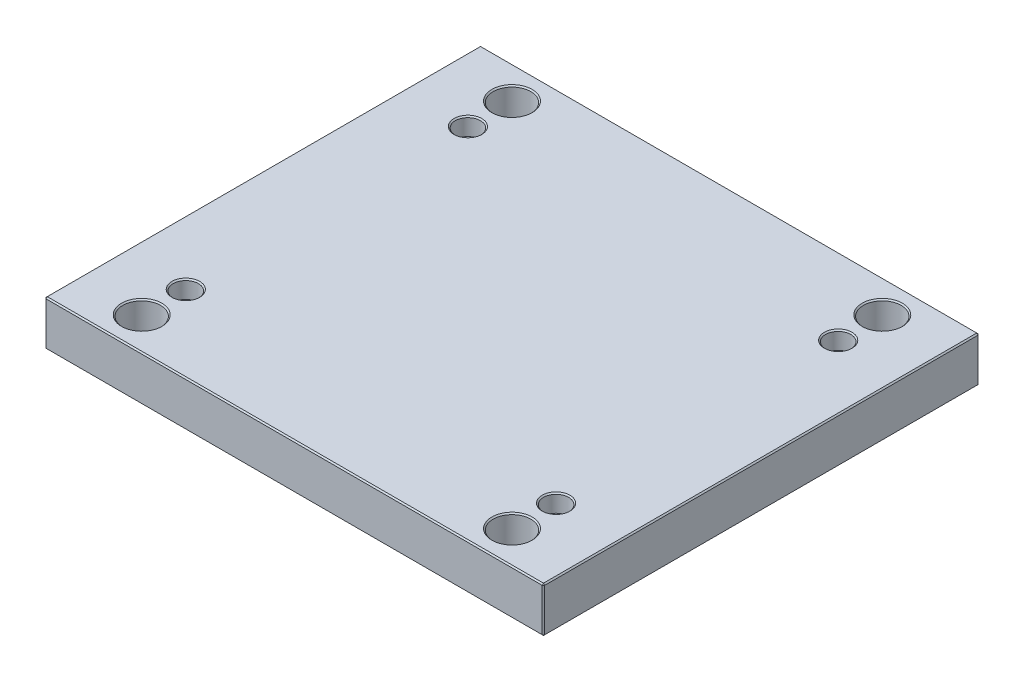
ISO-10303-21;
HEADER;
FILE_DESCRIPTION(('STEP AP214'),'2;1');
FILE_NAME('part.step','',(''),(''),'','','');
FILE_SCHEMA(('AUTOMOTIVE_DESIGN { 1 0 10303 214 1 1 1 1 }'));
ENDSEC;
DATA;
#1=APPLICATION_CONTEXT('core data for automotive mechanical design processes');
#2=APPLICATION_PROTOCOL_DEFINITION('international standard','automotive_design',2000,#1);
#3=PRODUCT_CONTEXT('',#1,'mechanical');
#4=PRODUCT('Part','Part','',(#3));
#5=PRODUCT_RELATED_PRODUCT_CATEGORY('part','',(#4));
#6=PRODUCT_DEFINITION_FORMATION('','',#4);
#7=PRODUCT_DEFINITION_CONTEXT('part definition',#1,'design');
#8=PRODUCT_DEFINITION('design','',#6,#7);
#9=PRODUCT_DEFINITION_SHAPE('','',#8);
#10=(LENGTH_UNIT() NAMED_UNIT(*) SI_UNIT(.MILLI.,.METRE.));
#11=(NAMED_UNIT(*) PLANE_ANGLE_UNIT() SI_UNIT($,.RADIAN.));
#12=(NAMED_UNIT(*) SI_UNIT($,.STERADIAN.) SOLID_ANGLE_UNIT());
#13=UNCERTAINTY_MEASURE_WITH_UNIT(LENGTH_MEASURE(1.E-05),#10,'distance_accuracy_value','');
#14=(GEOMETRIC_REPRESENTATION_CONTEXT(3) GLOBAL_UNCERTAINTY_ASSIGNED_CONTEXT((#13)) GLOBAL_UNIT_ASSIGNED_CONTEXT((#10,
#11,#12)) REPRESENTATION_CONTEXT('',''));
#15=CARTESIAN_POINT('',(0.,0.,0.));
#16=DIRECTION('',(0.,0.,1.));
#17=DIRECTION('',(1.,0.,0.));
#18=AXIS2_PLACEMENT_3D('',#15,#16,#17);
#19=CARTESIAN_POINT('',(-198.,36.,173.));
#20=DIRECTION('',(1.,0.,0.));
#21=DIRECTION('',(0.,0.,-1.));
#22=AXIS2_PLACEMENT_3D('',#19,#20,#21);
#23=PLANE('',#22);
#24=DIRECTION('',(0.,-1.,0.));
#25=VECTOR('',#24,1.);
#26=CARTESIAN_POINT('',(-198.,36.,-172.));
#27=LINE('',#26,#25);
#28=CARTESIAN_POINT('',(-198.,35.,-172.));
#29=VERTEX_POINT('',#28);
#30=CARTESIAN_POINT('',(-198.,1.,-172.));
#31=VERTEX_POINT('',#30);
#32=EDGE_CURVE('E115',#29,#31,#27,.T.);
#33=ORIENTED_EDGE('',*,*,#32,.T.);
#34=DIRECTION('',(0.,0.,1.));
#35=VECTOR('',#34,1.);
#36=CARTESIAN_POINT('',(-198.,1.,173.));
#37=LINE('',#36,#35);
#38=CARTESIAN_POINT('',(-198.,1.,172.));
#39=VERTEX_POINT('',#38);
#40=EDGE_CURVE('E111',#31,#39,#37,.T.);
#41=ORIENTED_EDGE('',*,*,#40,.T.);
#42=DIRECTION('',(0.,1.,0.));
#43=VECTOR('',#42,1.);
#44=CARTESIAN_POINT('',(-198.,36.,172.));
#45=LINE('',#44,#43);
#46=CARTESIAN_POINT('',(-198.,35.,172.));
#47=VERTEX_POINT('',#46);
#48=EDGE_CURVE('E104',#39,#47,#45,.T.);
#49=ORIENTED_EDGE('',*,*,#48,.T.);
#50=DIRECTION('',(0.,0.,-1.));
#51=VECTOR('',#50,1.);
#52=CARTESIAN_POINT('',(-198.,35.,-173.));
#53=LINE('',#52,#51);
#54=EDGE_CURVE('E108',#47,#29,#53,.T.);
#55=ORIENTED_EDGE('',*,*,#54,.T.);
#56=EDGE_LOOP('',(#33,#41,#49,#55));
#57=FACE_BOUND('',#56,.T.);
#58=ADVANCED_FACE('F16',(#57),#23,.F.);
#59=CARTESIAN_POINT('',(198.,36.,173.));
#60=DIRECTION('',(0.,0.,-1.));
#61=DIRECTION('',(-1.,0.,0.));
#62=AXIS2_PLACEMENT_3D('',#59,#60,#61);
#63=PLANE('',#62);
#64=DIRECTION('',(-1.,0.,0.));
#65=VECTOR('',#64,1.);
#66=CARTESIAN_POINT('',(-198.,35.,173.));
#67=LINE('',#66,#65);
#68=CARTESIAN_POINT('',(197.,35.,173.));
#69=VERTEX_POINT('',#68);
#70=CARTESIAN_POINT('',(-197.,35.,173.));
#71=VERTEX_POINT('',#70);
#72=EDGE_CURVE('E170',#69,#71,#67,.T.);
#73=ORIENTED_EDGE('',*,*,#72,.T.);
#74=DIRECTION('',(0.,-1.,0.));
#75=VECTOR('',#74,1.);
#76=CARTESIAN_POINT('',(-197.,36.,173.));
#77=LINE('',#76,#75);
#78=CARTESIAN_POINT('',(-197.,1.00000000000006,173.));
#79=VERTEX_POINT('',#78);
#80=EDGE_CURVE('E123',#71,#79,#77,.T.);
#81=ORIENTED_EDGE('',*,*,#80,.T.);
#82=DIRECTION('',(1.,0.,0.));
#83=VECTOR('',#82,1.);
#84=CARTESIAN_POINT('',(198.,1.00000000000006,173.));
#85=LINE('',#84,#83);
#86=CARTESIAN_POINT('',(197.,1.00000000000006,173.));
#87=VERTEX_POINT('',#86);
#88=EDGE_CURVE('E174',#79,#87,#85,.T.);
#89=ORIENTED_EDGE('',*,*,#88,.T.);
#90=DIRECTION('',(0.,1.,0.));
#91=VECTOR('',#90,1.);
#92=CARTESIAN_POINT('',(197.,36.,173.));
#93=LINE('',#92,#91);
#94=EDGE_CURVE('E172',#87,#69,#93,.T.);
#95=ORIENTED_EDGE('',*,*,#94,.T.);
#96=EDGE_LOOP('',(#73,#81,#89,#95));
#97=FACE_BOUND('',#96,.T.);
#98=ADVANCED_FACE('F413',(#97),#63,.F.);
#99=CARTESIAN_POINT('',(198.,36.,173.));
#100=DIRECTION('',(-1.,0.,0.));
#101=DIRECTION('',(0.,0.,1.));
#102=AXIS2_PLACEMENT_3D('',#99,#100,#101);
#103=PLANE('',#102);
#104=DIRECTION('',(0.,0.,-1.));
#105=VECTOR('',#104,1.);
#106=CARTESIAN_POINT('',(198.,1.00000000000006,173.));
#107=LINE('',#106,#105);
#108=CARTESIAN_POINT('',(198.,1.00000000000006,172.));
#109=VERTEX_POINT('',#108);
#110=CARTESIAN_POINT('',(198.,1.00000000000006,-172.));
#111=VERTEX_POINT('',#110);
#112=EDGE_CURVE('E165',#109,#111,#107,.T.);
#113=ORIENTED_EDGE('',*,*,#112,.T.);
#114=DIRECTION('',(0.,1.,0.));
#115=VECTOR('',#114,1.);
#116=CARTESIAN_POINT('',(198.,36.,-172.));
#117=LINE('',#116,#115);
#118=CARTESIAN_POINT('',(198.,35.,-172.));
#119=VERTEX_POINT('',#118);
#120=EDGE_CURVE('E167',#111,#119,#117,.T.);
#121=ORIENTED_EDGE('',*,*,#120,.T.);
#122=DIRECTION('',(0.,0.,1.));
#123=VECTOR('',#122,1.);
#124=CARTESIAN_POINT('',(198.,35.,173.));
#125=LINE('',#124,#123);
#126=CARTESIAN_POINT('',(198.,35.,172.));
#127=VERTEX_POINT('',#126);
#128=EDGE_CURVE('E161',#119,#127,#125,.T.);
#129=ORIENTED_EDGE('',*,*,#128,.T.);
#130=DIRECTION('',(0.,-1.,0.));
#131=VECTOR('',#130,1.);
#132=CARTESIAN_POINT('',(198.,36.,172.));
#133=LINE('',#132,#131);
#134=EDGE_CURVE('E163',#127,#109,#133,.T.);
#135=ORIENTED_EDGE('',*,*,#134,.T.);
#136=EDGE_LOOP('',(#113,#121,#129,#135));
#137=FACE_BOUND('',#136,.T.);
#138=ADVANCED_FACE('F406',(#137),#103,.F.);
#139=CARTESIAN_POINT('',(198.,36.,-173.));
#140=DIRECTION('',(0.,0.,1.));
#141=DIRECTION('',(1.,0.,0.));
#142=AXIS2_PLACEMENT_3D('',#139,#140,#141);
#143=PLANE('',#142);
#144=DIRECTION('',(0.,-1.,0.));
#145=VECTOR('',#144,1.);
#146=CARTESIAN_POINT('',(197.,36.,-173.));
#147=LINE('',#146,#145);
#148=CARTESIAN_POINT('',(197.,35.,-173.));
#149=VERTEX_POINT('',#148);
#150=CARTESIAN_POINT('',(197.,1.00000000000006,-173.));
#151=VERTEX_POINT('',#150);
#152=EDGE_CURVE('E154',#149,#151,#147,.T.);
#153=ORIENTED_EDGE('',*,*,#152,.T.);
#154=DIRECTION('',(-1.,0.,0.));
#155=VECTOR('',#154,1.);
#156=CARTESIAN_POINT('',(198.,1.00000000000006,-173.));
#157=LINE('',#156,#155);
#158=CARTESIAN_POINT('',(-197.,1.00000000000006,-173.));
#159=VERTEX_POINT('',#158);
#160=EDGE_CURVE('E159',#151,#159,#157,.T.);
#161=ORIENTED_EDGE('',*,*,#160,.T.);
#162=DIRECTION('',(0.,1.,0.));
#163=VECTOR('',#162,1.);
#164=CARTESIAN_POINT('',(-197.,36.,-173.));
#165=LINE('',#164,#163);
#166=CARTESIAN_POINT('',(-197.,35.,-173.));
#167=VERTEX_POINT('',#166);
#168=EDGE_CURVE('E156',#159,#167,#165,.T.);
#169=ORIENTED_EDGE('',*,*,#168,.T.);
#170=DIRECTION('',(1.,0.,0.));
#171=VECTOR('',#170,1.);
#172=CARTESIAN_POINT('',(198.,35.,-173.));
#173=LINE('',#172,#171);
#174=EDGE_CURVE('E152',#167,#149,#173,.T.);
#175=ORIENTED_EDGE('',*,*,#174,.T.);
#176=EDGE_LOOP('',(#153,#161,#169,#175));
#177=FACE_BOUND('',#176,.T.);
#178=ADVANCED_FACE('F431',(#177),#143,.F.);
#179=CARTESIAN_POINT('',(0.,36.,0.));
#180=DIRECTION('',(0.,1.,0.));
#181=DIRECTION('',(0.,0.,1.));
#182=AXIS2_PLACEMENT_3D('',#179,#180,#181);
#183=PLANE('',#182);
#184=CARTESIAN_POINT('',(-147.,36.,147.));
#185=DIRECTION('',(0.,1.,0.));
#186=DIRECTION('',(0.,0.,1.));
#187=AXIS2_PLACEMENT_3D('',#184,#185,#186);
#188=CIRCLE('',#187,16.);
#189=CARTESIAN_POINT('',(-147.,36.,163.));
#190=VERTEX_POINT('',#189);
#191=EDGE_CURVE('E317',#190,#190,#188,.F.);
#192=ORIENTED_EDGE('',*,*,#191,.T.);
#193=EDGE_LOOP('',(#192));
#194=FACE_BOUND('',#193,.T.);
#195=CARTESIAN_POINT('',(147.,36.,147.));
#196=DIRECTION('',(0.,1.,0.));
#197=DIRECTION('',(0.,0.,1.));
#198=AXIS2_PLACEMENT_3D('',#195,#196,#197);
#199=CIRCLE('',#198,16.);
#200=CARTESIAN_POINT('',(147.,36.,163.));
#201=VERTEX_POINT('',#200);
#202=EDGE_CURVE('E314',#201,#201,#199,.F.);
#203=ORIENTED_EDGE('',*,*,#202,.T.);
#204=EDGE_LOOP('',(#203));
#205=FACE_BOUND('',#204,.T.);
#206=CARTESIAN_POINT('',(147.,36.,-147.));
#207=DIRECTION('',(0.,1.,0.));
#208=DIRECTION('',(0.,0.,1.));
#209=AXIS2_PLACEMENT_3D('',#206,#207,#208);
#210=CIRCLE('',#209,16.);
#211=CARTESIAN_POINT('',(147.,36.,-131.));
#212=VERTEX_POINT('',#211);
#213=EDGE_CURVE('E311',#212,#212,#210,.F.);
#214=ORIENTED_EDGE('',*,*,#213,.T.);
#215=EDGE_LOOP('',(#214));
#216=FACE_BOUND('',#215,.T.);
#217=CARTESIAN_POINT('',(-147.,36.,-147.));
#218=DIRECTION('',(0.,1.,0.));
#219=DIRECTION('',(0.,0.,1.));
#220=AXIS2_PLACEMENT_3D('',#217,#218,#219);
#221=CIRCLE('',#220,16.);
#222=CARTESIAN_POINT('',(-147.,36.,-131.));
#223=VERTEX_POINT('',#222);
#224=EDGE_CURVE('E308',#223,#223,#221,.F.);
#225=ORIENTED_EDGE('',*,*,#224,.T.);
#226=EDGE_LOOP('',(#225));
#227=FACE_BOUND('',#226,.T.);
#228=CARTESIAN_POINT('',(-147.,36.,112.));
#229=DIRECTION('',(0.,1.,0.));
#230=DIRECTION('',(0.,0.,1.));
#231=AXIS2_PLACEMENT_3D('',#228,#229,#230);
#232=CIRCLE('',#231,11.);
#233=CARTESIAN_POINT('',(-147.,36.,123.));
#234=VERTEX_POINT('',#233);
#235=EDGE_CURVE('E290',#234,#234,#232,.F.);
#236=ORIENTED_EDGE('',*,*,#235,.T.);
#237=EDGE_LOOP('',(#236));
#238=FACE_BOUND('',#237,.T.);
#239=CARTESIAN_POINT('',(147.,36.,112.));
#240=DIRECTION('',(0.,1.,0.));
#241=DIRECTION('',(0.,0.,1.));
#242=AXIS2_PLACEMENT_3D('',#239,#240,#241);
#243=CIRCLE('',#242,11.);
#244=CARTESIAN_POINT('',(147.,36.,123.));
#245=VERTEX_POINT('',#244);
#246=EDGE_CURVE('E287',#245,#245,#243,.F.);
#247=ORIENTED_EDGE('',*,*,#246,.T.);
#248=EDGE_LOOP('',(#247));
#249=FACE_BOUND('',#248,.T.);
#250=CARTESIAN_POINT('',(147.,36.,-112.));
#251=DIRECTION('',(0.,1.,0.));
#252=DIRECTION('',(0.,0.,1.));
#253=AXIS2_PLACEMENT_3D('',#250,#251,#252);
#254=CIRCLE('',#253,11.);
#255=CARTESIAN_POINT('',(147.,36.,-101.));
#256=VERTEX_POINT('',#255);
#257=EDGE_CURVE('E284',#256,#256,#254,.F.);
#258=ORIENTED_EDGE('',*,*,#257,.T.);
#259=EDGE_LOOP('',(#258));
#260=FACE_BOUND('',#259,.T.);
#261=CARTESIAN_POINT('',(-147.,36.,-112.));
#262=DIRECTION('',(0.,1.,0.));
#263=DIRECTION('',(0.,0.,1.));
#264=AXIS2_PLACEMENT_3D('',#261,#262,#263);
#265=CIRCLE('',#264,11.);
#266=CARTESIAN_POINT('',(-147.,36.,-101.));
#267=VERTEX_POINT('',#266);
#268=EDGE_CURVE('E281',#267,#267,#265,.F.);
#269=ORIENTED_EDGE('',*,*,#268,.T.);
#270=EDGE_LOOP('',(#269));
#271=FACE_BOUND('',#270,.T.);
#272=DIRECTION('',(0.,0.,-1.));
#273=VECTOR('',#272,1.);
#274=CARTESIAN_POINT('',(197.,36.,-173.));
#275=LINE('',#274,#273);
#276=CARTESIAN_POINT('',(197.,36.,172.));
#277=VERTEX_POINT('',#276);
#278=CARTESIAN_POINT('',(197.,36.,-172.));
#279=VERTEX_POINT('',#278);
#280=EDGE_CURVE('E31',#277,#279,#275,.T.);
#281=ORIENTED_EDGE('',*,*,#280,.T.);
#282=DIRECTION('',(-1.,0.,0.));
#283=VECTOR('',#282,1.);
#284=CARTESIAN_POINT('',(-198.,36.,-172.));
#285=LINE('',#284,#283);
#286=CARTESIAN_POINT('',(-197.,36.,-172.));
#287=VERTEX_POINT('',#286);
#288=EDGE_CURVE('E190',#279,#287,#285,.T.);
#289=ORIENTED_EDGE('',*,*,#288,.T.);
#290=DIRECTION('',(0.,0.,1.));
#291=VECTOR('',#290,1.);
#292=CARTESIAN_POINT('',(-197.,36.,173.));
#293=LINE('',#292,#291);
#294=CARTESIAN_POINT('',(-197.,36.,172.));
#295=VERTEX_POINT('',#294);
#296=EDGE_CURVE('E186',#287,#295,#293,.T.);
#297=ORIENTED_EDGE('',*,*,#296,.T.);
#298=DIRECTION('',(1.,0.,0.));
#299=VECTOR('',#298,1.);
#300=CARTESIAN_POINT('',(198.,36.,172.));
#301=LINE('',#300,#299);
#302=EDGE_CURVE('E36',#295,#277,#301,.T.);
#303=ORIENTED_EDGE('',*,*,#302,.T.);
#304=EDGE_LOOP('',(#281,#289,#297,#303));
#305=FACE_BOUND('',#304,.T.);
#306=ADVANCED_FACE('F357',(#194,#205,#216,#227,#238,#249,#260,#271,#305),#183,.T.);
#307=CARTESIAN_POINT('',(0.,0.,0.));
#308=DIRECTION('',(0.,1.,0.));
#309=DIRECTION('',(0.,0.,1.));
#310=AXIS2_PLACEMENT_3D('',#307,#308,#309);
#311=PLANE('',#310);
#312=CARTESIAN_POINT('',(-147.,0.,147.));
#313=DIRECTION('',(0.,1.,0.));
#314=DIRECTION('',(0.,0.,1.));
#315=AXIS2_PLACEMENT_3D('',#312,#313,#314);
#316=CIRCLE('',#315,16.);
#317=CARTESIAN_POINT('',(-147.,0.,163.));
#318=VERTEX_POINT('',#317);
#319=EDGE_CURVE('E329',#318,#318,#316,.T.);
#320=ORIENTED_EDGE('',*,*,#319,.T.);
#321=EDGE_LOOP('',(#320));
#322=FACE_BOUND('',#321,.T.);
#323=CARTESIAN_POINT('',(147.,0.,147.));
#324=DIRECTION('',(0.,1.,0.));
#325=DIRECTION('',(0.,0.,1.));
#326=AXIS2_PLACEMENT_3D('',#323,#324,#325);
#327=CIRCLE('',#326,16.);
#328=CARTESIAN_POINT('',(147.,0.,163.));
#329=VERTEX_POINT('',#328);
#330=EDGE_CURVE('E326',#329,#329,#327,.T.);
#331=ORIENTED_EDGE('',*,*,#330,.T.);
#332=EDGE_LOOP('',(#331));
#333=FACE_BOUND('',#332,.T.);
#334=CARTESIAN_POINT('',(147.,0.,-147.));
#335=DIRECTION('',(0.,1.,0.));
#336=DIRECTION('',(0.,0.,1.));
#337=AXIS2_PLACEMENT_3D('',#334,#335,#336);
#338=CIRCLE('',#337,16.);
#339=CARTESIAN_POINT('',(147.,0.,-131.));
#340=VERTEX_POINT('',#339);
#341=EDGE_CURVE('E323',#340,#340,#338,.T.);
#342=ORIENTED_EDGE('',*,*,#341,.T.);
#343=EDGE_LOOP('',(#342));
#344=FACE_BOUND('',#343,.T.);
#345=CARTESIAN_POINT('',(-147.,0.,-147.));
#346=DIRECTION('',(0.,1.,0.));
#347=DIRECTION('',(0.,0.,1.));
#348=AXIS2_PLACEMENT_3D('',#345,#346,#347);
#349=CIRCLE('',#348,16.);
#350=CARTESIAN_POINT('',(-147.,0.,-131.));
#351=VERTEX_POINT('',#350);
#352=EDGE_CURVE('E320',#351,#351,#349,.T.);
#353=ORIENTED_EDGE('',*,*,#352,.T.);
#354=EDGE_LOOP('',(#353));
#355=FACE_BOUND('',#354,.T.);
#356=CARTESIAN_POINT('',(147.,0.,-112.));
#357=DIRECTION('',(0.,1.,0.));
#358=DIRECTION('',(0.,0.,1.));
#359=AXIS2_PLACEMENT_3D('',#356,#357,#358);
#360=CIRCLE('',#359,8.00000000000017);
#361=CARTESIAN_POINT('',(147.,0.,-104.));
#362=VERTEX_POINT('',#361);
#363=EDGE_CURVE('E263',#362,#362,#360,.T.);
#364=ORIENTED_EDGE('',*,*,#363,.T.);
#365=EDGE_LOOP('',(#364));
#366=FACE_BOUND('',#365,.T.);
#367=CARTESIAN_POINT('',(147.,0.,112.));
#368=DIRECTION('',(0.,1.,0.));
#369=DIRECTION('',(0.,0.,1.));
#370=AXIS2_PLACEMENT_3D('',#367,#368,#369);
#371=CIRCLE('',#370,8.);
#372=CARTESIAN_POINT('',(147.,0.,120.));
#373=VERTEX_POINT('',#372);
#374=EDGE_CURVE('E260',#373,#373,#371,.T.);
#375=ORIENTED_EDGE('',*,*,#374,.T.);
#376=EDGE_LOOP('',(#375));
#377=FACE_BOUND('',#376,.T.);
#378=CARTESIAN_POINT('',(-147.,0.,112.));
#379=DIRECTION('',(0.,1.,0.));
#380=DIRECTION('',(0.,0.,1.));
#381=AXIS2_PLACEMENT_3D('',#378,#379,#380);
#382=CIRCLE('',#381,8.);
#383=CARTESIAN_POINT('',(-147.,0.,120.));
#384=VERTEX_POINT('',#383);
#385=EDGE_CURVE('E257',#384,#384,#382,.T.);
#386=ORIENTED_EDGE('',*,*,#385,.T.);
#387=EDGE_LOOP('',(#386));
#388=FACE_BOUND('',#387,.T.);
#389=CARTESIAN_POINT('',(-147.,0.,-112.));
#390=DIRECTION('',(0.,1.,0.));
#391=DIRECTION('',(0.,0.,1.));
#392=AXIS2_PLACEMENT_3D('',#389,#390,#391);
#393=CIRCLE('',#392,8.);
#394=CARTESIAN_POINT('',(-147.,0.,-104.));
#395=VERTEX_POINT('',#394);
#396=EDGE_CURVE('E192',#395,#395,#393,.T.);
#397=ORIENTED_EDGE('',*,*,#396,.T.);
#398=EDGE_LOOP('',(#397));
#399=FACE_BOUND('',#398,.T.);
#400=DIRECTION('',(0.,0.,1.));
#401=VECTOR('',#400,1.);
#402=CARTESIAN_POINT('',(197.,0.,0.));
#403=LINE('',#402,#401);
#404=CARTESIAN_POINT('',(197.,0.,-172.));
#405=VERTEX_POINT('',#404);
#406=CARTESIAN_POINT('',(197.,0.,172.));
#407=VERTEX_POINT('',#406);
#408=EDGE_CURVE('E177',#405,#407,#403,.T.);
#409=ORIENTED_EDGE('',*,*,#408,.T.);
#410=DIRECTION('',(-1.,0.,0.));
#411=VECTOR('',#410,1.);
#412=CARTESIAN_POINT('',(0.,0.,172.));
#413=LINE('',#412,#411);
#414=CARTESIAN_POINT('',(-197.,0.,172.));
#415=VERTEX_POINT('',#414);
#416=EDGE_CURVE('E183',#407,#415,#413,.T.);
#417=ORIENTED_EDGE('',*,*,#416,.T.);
#418=DIRECTION('',(0.,0.,-1.));
#419=VECTOR('',#418,1.);
#420=CARTESIAN_POINT('',(-197.,0.,0.));
#421=LINE('',#420,#419);
#422=CARTESIAN_POINT('',(-197.,0.,-172.));
#423=VERTEX_POINT('',#422);
#424=EDGE_CURVE('E181',#415,#423,#421,.T.);
#425=ORIENTED_EDGE('',*,*,#424,.T.);
#426=DIRECTION('',(1.,0.,0.));
#427=VECTOR('',#426,1.);
#428=CARTESIAN_POINT('',(0.,0.,-172.));
#429=LINE('',#428,#427);
#430=EDGE_CURVE('E179',#423,#405,#429,.T.);
#431=ORIENTED_EDGE('',*,*,#430,.T.);
#432=EDGE_LOOP('',(#409,#417,#425,#431));
#433=FACE_BOUND('',#432,.T.);
#434=ADVANCED_FACE('F353',(#322,#333,#344,#355,#366,#377,#388,#399,#433),#311,.F.);
#435=CARTESIAN_POINT('',(198.,36.,172.));
#436=DIRECTION('',(-0.707106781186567,0.,-0.707106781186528));
#437=DIRECTION('',(0.,-1.,0.));
#438=AXIS2_PLACEMENT_3D('',#435,#436,#437);
#439=PLANE('',#438);
#440=DIRECTION('',(-0.707106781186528,0.,0.707106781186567));
#441=VECTOR('',#440,1.);
#442=CARTESIAN_POINT('',(197.,35.,173.));
#443=LINE('',#442,#441);
#444=EDGE_CURVE('E141',#69,#127,#443,.F.);
#445=ORIENTED_EDGE('',*,*,#444,.F.);
#446=ORIENTED_EDGE('',*,*,#94,.F.);
#447=DIRECTION('',(0.707106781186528,0.,-0.707106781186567));
#448=VECTOR('',#447,1.);
#449=CARTESIAN_POINT('',(197.,1.00000000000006,173.));
#450=LINE('',#449,#448);
#451=EDGE_CURVE('E144',#109,#87,#450,.F.);
#452=ORIENTED_EDGE('',*,*,#451,.F.);
#453=ORIENTED_EDGE('',*,*,#134,.F.);
#454=EDGE_LOOP('',(#445,#446,#452,#453));
#455=FACE_BOUND('',#454,.T.);
#456=ADVANCED_FACE('F356',(#455),#439,.F.);
#457=CARTESIAN_POINT('',(197.,35.,173.));
#458=DIRECTION('',(0.577350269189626,0.577350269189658,0.577350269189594));
#459=DIRECTION('',(-0.707106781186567,0.707106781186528,0.));
#460=AXIS2_PLACEMENT_3D('',#457,#458,#459);
#461=PLANE('',#460);
#462=DIRECTION('',(0.,-0.707106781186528,0.707106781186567));
#463=VECTOR('',#462,1.);
#464=CARTESIAN_POINT('',(197.,35.,173.));
#465=LINE('',#464,#463);
#466=EDGE_CURVE('E235',#69,#277,#465,.F.);
#467=ORIENTED_EDGE('',*,*,#466,.F.);
#468=ORIENTED_EDGE('',*,*,#444,.T.);
#469=DIRECTION('',(-0.707106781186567,0.707106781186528,0.));
#470=VECTOR('',#469,1.);
#471=CARTESIAN_POINT('',(197.5,35.5,172.));
#472=LINE('',#471,#470);
#473=EDGE_CURVE('E237',#277,#127,#472,.F.);
#474=ORIENTED_EDGE('',*,*,#473,.F.);
#475=EDGE_LOOP('',(#467,#468,#474));
#476=FACE_BOUND('',#475,.T.);
#477=ADVANCED_FACE('F419',(#476),#461,.T.);
#478=CARTESIAN_POINT('',(197.,1.00000000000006,173.));
#479=DIRECTION('',(0.577350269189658,-0.577350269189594,0.577350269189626));
#480=DIRECTION('',(0.707106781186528,0.,-0.707106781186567));
#481=AXIS2_PLACEMENT_3D('',#478,#479,#480);
#482=PLANE('',#481);
#483=DIRECTION('',(-0.707106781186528,-0.707106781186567,0.));
#484=VECTOR('',#483,1.);
#485=CARTESIAN_POINT('',(197.5,0.500000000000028,172.));
#486=LINE('',#485,#484);
#487=EDGE_CURVE('E229',#109,#407,#486,.T.);
#488=ORIENTED_EDGE('',*,*,#487,.F.);
#489=ORIENTED_EDGE('',*,*,#451,.T.);
#490=DIRECTION('',(0.,0.707106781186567,0.707106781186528));
#491=VECTOR('',#490,1.);
#492=CARTESIAN_POINT('',(197.,1.00000000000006,173.));
#493=LINE('',#492,#491);
#494=EDGE_CURVE('E232',#407,#87,#493,.T.);
#495=ORIENTED_EDGE('',*,*,#494,.F.);
#496=EDGE_LOOP('',(#488,#489,#495));
#497=FACE_BOUND('',#496,.T.);
#498=ADVANCED_FACE('F378',(#497),#482,.T.);
#499=CARTESIAN_POINT('',(197.,36.,0.));
#500=DIRECTION('',(0.707106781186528,0.707106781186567,0.));
#501=DIRECTION('',(0.,0.,1.));
#502=AXIS2_PLACEMENT_3D('',#499,#500,#501);
#503=PLANE('',#502);
#504=ORIENTED_EDGE('',*,*,#473,.T.);
#505=ORIENTED_EDGE('',*,*,#128,.F.);
#506=DIRECTION('',(0.707106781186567,-0.707106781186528,0.));
#507=VECTOR('',#506,1.);
#508=CARTESIAN_POINT('',(198.,35.,-172.));
#509=LINE('',#508,#507);
#510=EDGE_CURVE('E224',#279,#119,#509,.T.);
#511=ORIENTED_EDGE('',*,*,#510,.F.);
#512=ORIENTED_EDGE('',*,*,#280,.F.);
#513=EDGE_LOOP('',(#504,#505,#511,#512));
#514=FACE_BOUND('',#513,.T.);
#515=ADVANCED_FACE('F421',(#514),#503,.T.);
#516=CARTESIAN_POINT('',(0.,36.,172.));
#517=DIRECTION('',(0.,0.707106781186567,0.707106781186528));
#518=DIRECTION('',(-1.,0.,0.));
#519=AXIS2_PLACEMENT_3D('',#516,#517,#518);
#520=PLANE('',#519);
#521=ORIENTED_EDGE('',*,*,#466,.T.);
#522=ORIENTED_EDGE('',*,*,#302,.F.);
#523=DIRECTION('',(0.,0.707106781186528,-0.707106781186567));
#524=VECTOR('',#523,1.);
#525=CARTESIAN_POINT('',(-197.,35.5,172.5));
#526=LINE('',#525,#524);
#527=EDGE_CURVE('E127',#71,#295,#526,.T.);
#528=ORIENTED_EDGE('',*,*,#527,.F.);
#529=ORIENTED_EDGE('',*,*,#72,.F.);
#530=EDGE_LOOP('',(#521,#522,#528,#529));
#531=FACE_BOUND('',#530,.T.);
#532=ADVANCED_FACE('F416',(#531),#520,.T.);
#533=CARTESIAN_POINT('',(-197.,36.,173.));
#534=DIRECTION('',(0.707106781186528,0.,-0.707106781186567));
#535=DIRECTION('',(0.,-1.,0.));
#536=AXIS2_PLACEMENT_3D('',#533,#534,#535);
#537=PLANE('',#536);
#538=DIRECTION('',(0.707106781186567,0.,0.707106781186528));
#539=VECTOR('',#538,1.);
#540=CARTESIAN_POINT('',(-197.,1.00000000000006,173.));
#541=LINE('',#540,#539);
#542=EDGE_CURVE('E128',#79,#39,#541,.F.);
#543=ORIENTED_EDGE('',*,*,#542,.F.);
#544=ORIENTED_EDGE('',*,*,#80,.F.);
#545=DIRECTION('',(-0.707106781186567,0.,-0.707106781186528));
#546=VECTOR('',#545,1.);
#547=CARTESIAN_POINT('',(-198.,35.,172.));
#548=LINE('',#547,#546);
#549=EDGE_CURVE('E119',#47,#71,#548,.F.);
#550=ORIENTED_EDGE('',*,*,#549,.F.);
#551=ORIENTED_EDGE('',*,*,#48,.F.);
#552=EDGE_LOOP('',(#543,#544,#550,#551));
#553=FACE_BOUND('',#552,.T.);
#554=ADVANCED_FACE('F121',(#553),#537,.F.);
#555=CARTESIAN_POINT('',(198.,1.00000000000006,173.));
#556=DIRECTION('',(0.,0.707106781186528,-0.707106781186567));
#557=DIRECTION('',(1.,0.,0.));
#558=AXIS2_PLACEMENT_3D('',#555,#556,#557);
#559=PLANE('',#558);
#560=ORIENTED_EDGE('',*,*,#494,.T.);
#561=ORIENTED_EDGE('',*,*,#88,.F.);
#562=DIRECTION('',(0.,-0.707106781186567,-0.707106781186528));
#563=VECTOR('',#562,1.);
#564=CARTESIAN_POINT('',(-197.,1.00000000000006,173.));
#565=LINE('',#564,#563);
#566=EDGE_CURVE('E220',#415,#79,#565,.F.);
#567=ORIENTED_EDGE('',*,*,#566,.F.);
#568=ORIENTED_EDGE('',*,*,#416,.F.);
#569=EDGE_LOOP('',(#560,#561,#567,#568));
#570=FACE_BOUND('',#569,.T.);
#571=ADVANCED_FACE('F383',(#570),#559,.F.);
#572=CARTESIAN_POINT('',(198.,1.00000000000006,173.));
#573=DIRECTION('',(-0.707106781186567,0.707106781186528,0.));
#574=DIRECTION('',(0.,0.,-1.));
#575=AXIS2_PLACEMENT_3D('',#572,#573,#574);
#576=PLANE('',#575);
#577=ORIENTED_EDGE('',*,*,#487,.T.);
#578=ORIENTED_EDGE('',*,*,#408,.F.);
#579=DIRECTION('',(0.707106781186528,0.707106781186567,0.));
#580=VECTOR('',#579,1.);
#581=CARTESIAN_POINT('',(197.5,0.5,-172.));
#582=LINE('',#581,#580);
#583=EDGE_CURVE('E217',#111,#405,#582,.F.);
#584=ORIENTED_EDGE('',*,*,#583,.F.);
#585=ORIENTED_EDGE('',*,*,#112,.F.);
#586=EDGE_LOOP('',(#577,#578,#584,#585));
#587=FACE_BOUND('',#586,.T.);
#588=ADVANCED_FACE('F376',(#587),#576,.F.);
#589=CARTESIAN_POINT('',(197.,36.,-173.));
#590=DIRECTION('',(-0.707106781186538,0.,0.707106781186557));
#591=DIRECTION('',(0.,-1.,0.));
#592=AXIS2_PLACEMENT_3D('',#589,#590,#591);
#593=PLANE('',#592);
#594=DIRECTION('',(0.707106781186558,0.,0.707106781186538));
#595=VECTOR('',#594,1.);
#596=CARTESIAN_POINT('',(198.,35.,-172.));
#597=LINE('',#596,#595);
#598=EDGE_CURVE('E226',#119,#149,#597,.F.);
#599=ORIENTED_EDGE('',*,*,#598,.F.);
#600=ORIENTED_EDGE('',*,*,#120,.F.);
#601=DIRECTION('',(-0.707106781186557,0.,-0.707106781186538));
#602=VECTOR('',#601,1.);
#603=CARTESIAN_POINT('',(197.,1.00000000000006,-173.));
#604=LINE('',#603,#602);
#605=EDGE_CURVE('E214',#151,#111,#604,.F.);
#606=ORIENTED_EDGE('',*,*,#605,.F.);
#607=ORIENTED_EDGE('',*,*,#152,.F.);
#608=EDGE_LOOP('',(#599,#600,#606,#607));
#609=FACE_BOUND('',#608,.T.);
#610=ADVANCED_FACE('F403',(#609),#593,.F.);
#611=CARTESIAN_POINT('',(198.,35.,-172.));
#612=DIRECTION('',(0.57735026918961,0.577350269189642,-0.577350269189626));
#613=DIRECTION('',(0.,0.707106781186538,0.707106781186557));
#614=AXIS2_PLACEMENT_3D('',#611,#612,#613);
#615=PLANE('',#614);
#616=ORIENTED_EDGE('',*,*,#510,.T.);
#617=ORIENTED_EDGE('',*,*,#598,.T.);
#618=DIRECTION('',(0.,0.707106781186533,0.707106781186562));
#619=VECTOR('',#618,1.);
#620=CARTESIAN_POINT('',(197.,35.5,-172.5));
#621=LINE('',#620,#619);
#622=EDGE_CURVE('E135',#279,#149,#621,.F.);
#623=ORIENTED_EDGE('',*,*,#622,.F.);
#624=EDGE_LOOP('',(#616,#617,#623));
#625=FACE_BOUND('',#624,.T.);
#626=ADVANCED_FACE('F425',(#625),#615,.T.);
#627=CARTESIAN_POINT('',(-198.,35.,172.));
#628=DIRECTION('',(-0.577350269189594,0.577350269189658,0.577350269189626));
#629=DIRECTION('',(0.,-0.707106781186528,0.707106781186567));
#630=AXIS2_PLACEMENT_3D('',#627,#628,#629);
#631=PLANE('',#630);
#632=ORIENTED_EDGE('',*,*,#549,.T.);
#633=ORIENTED_EDGE('',*,*,#527,.T.);
#634=DIRECTION('',(-0.707106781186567,-0.707106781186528,0.));
#635=VECTOR('',#634,1.);
#636=CARTESIAN_POINT('',(-198.,35.,172.));
#637=LINE('',#636,#635);
#638=EDGE_CURVE('E131',#47,#295,#637,.F.);
#639=ORIENTED_EDGE('',*,*,#638,.F.);
#640=EDGE_LOOP('',(#632,#633,#639));
#641=FACE_BOUND('',#640,.T.);
#642=ADVANCED_FACE('F132',(#641),#631,.T.);
#643=CARTESIAN_POINT('',(-197.,1.00000000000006,173.));
#644=DIRECTION('',(-0.577350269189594,-0.577350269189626,0.577350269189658));
#645=DIRECTION('',(0.,-0.707106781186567,-0.707106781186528));
#646=AXIS2_PLACEMENT_3D('',#643,#644,#645);
#647=PLANE('',#646);
#648=ORIENTED_EDGE('',*,*,#566,.T.);
#649=ORIENTED_EDGE('',*,*,#542,.T.);
#650=DIRECTION('',(-0.707106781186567,0.707106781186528,0.));
#651=VECTOR('',#650,1.);
#652=CARTESIAN_POINT('',(-197.5,0.5,172.));
#653=LINE('',#652,#651);
#654=EDGE_CURVE('E136',#415,#39,#653,.T.);
#655=ORIENTED_EDGE('',*,*,#654,.F.);
#656=EDGE_LOOP('',(#648,#649,#655));
#657=FACE_BOUND('',#656,.T.);
#658=ADVANCED_FACE('F386',(#657),#647,.T.);
#659=CARTESIAN_POINT('',(197.,1.00000000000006,-173.));
#660=DIRECTION('',(0.577350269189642,-0.577350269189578,-0.577350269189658));
#661=DIRECTION('',(-0.707106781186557,0.,-0.707106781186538));
#662=AXIS2_PLACEMENT_3D('',#659,#660,#661);
#663=PLANE('',#662);
#664=ORIENTED_EDGE('',*,*,#605,.T.);
#665=ORIENTED_EDGE('',*,*,#583,.T.);
#666=DIRECTION('',(0.,-0.707106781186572,0.707106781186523));
#667=VECTOR('',#666,1.);
#668=CARTESIAN_POINT('',(197.,1.00000000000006,-173.));
#669=LINE('',#668,#667);
#670=EDGE_CURVE('E207',#151,#405,#669,.T.);
#671=ORIENTED_EDGE('',*,*,#670,.F.);
#672=EDGE_LOOP('',(#664,#665,#671));
#673=FACE_BOUND('',#672,.T.);
#674=ADVANCED_FACE('F397',(#673),#663,.T.);
#675=CARTESIAN_POINT('',(0.,36.,-172.));
#676=DIRECTION('',(0.,0.707106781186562,-0.707106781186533));
#677=DIRECTION('',(1.,0.,0.));
#678=AXIS2_PLACEMENT_3D('',#675,#676,#677);
#679=PLANE('',#678);
#680=ORIENTED_EDGE('',*,*,#622,.T.);
#681=ORIENTED_EDGE('',*,*,#174,.F.);
#682=DIRECTION('',(0.,-0.707106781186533,-0.707106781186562));
#683=VECTOR('',#682,1.);
#684=CARTESIAN_POINT('',(-197.,35.,-173.));
#685=LINE('',#684,#683);
#686=EDGE_CURVE('E204',#287,#167,#685,.T.);
#687=ORIENTED_EDGE('',*,*,#686,.F.);
#688=ORIENTED_EDGE('',*,*,#288,.F.);
#689=EDGE_LOOP('',(#680,#681,#687,#688));
#690=FACE_BOUND('',#689,.T.);
#691=ADVANCED_FACE('F429',(#690),#679,.T.);
#692=CARTESIAN_POINT('',(-197.,36.,0.));
#693=DIRECTION('',(-0.707106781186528,0.707106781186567,0.));
#694=DIRECTION('',(0.,0.,-1.));
#695=AXIS2_PLACEMENT_3D('',#692,#693,#694);
#696=PLANE('',#695);
#697=ORIENTED_EDGE('',*,*,#638,.T.);
#698=ORIENTED_EDGE('',*,*,#296,.F.);
#699=DIRECTION('',(0.707106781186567,0.707106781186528,0.));
#700=VECTOR('',#699,1.);
#701=CARTESIAN_POINT('',(-197.5,35.5,-172.));
#702=LINE('',#701,#700);
#703=EDGE_CURVE('E139',#29,#287,#702,.T.);
#704=ORIENTED_EDGE('',*,*,#703,.F.);
#705=ORIENTED_EDGE('',*,*,#54,.F.);
#706=EDGE_LOOP('',(#697,#698,#704,#705));
#707=FACE_BOUND('',#706,.T.);
#708=ADVANCED_FACE('F138',(#707),#696,.T.);
#709=CARTESIAN_POINT('',(-198.,1.,173.));
#710=DIRECTION('',(0.707106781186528,0.707106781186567,0.));
#711=DIRECTION('',(0.,0.,1.));
#712=AXIS2_PLACEMENT_3D('',#709,#710,#711);
#713=PLANE('',#712);
#714=ORIENTED_EDGE('',*,*,#654,.T.);
#715=ORIENTED_EDGE('',*,*,#40,.F.);
#716=DIRECTION('',(0.707106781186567,-0.707106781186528,0.));
#717=VECTOR('',#716,1.);
#718=CARTESIAN_POINT('',(-198.,1.,-172.));
#719=LINE('',#718,#717);
#720=EDGE_CURVE('E200',#423,#31,#719,.F.);
#721=ORIENTED_EDGE('',*,*,#720,.F.);
#722=ORIENTED_EDGE('',*,*,#424,.F.);
#723=EDGE_LOOP('',(#714,#715,#721,#722));
#724=FACE_BOUND('',#723,.T.);
#725=ADVANCED_FACE('F388',(#724),#713,.F.);
#726=CARTESIAN_POINT('',(198.,1.00000000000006,-173.));
#727=DIRECTION('',(0.,0.707106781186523,0.707106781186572));
#728=DIRECTION('',(-1.,0.,0.));
#729=AXIS2_PLACEMENT_3D('',#726,#727,#728);
#730=PLANE('',#729);
#731=ORIENTED_EDGE('',*,*,#670,.T.);
#732=ORIENTED_EDGE('',*,*,#430,.F.);
#733=DIRECTION('',(0.,0.707106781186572,-0.707106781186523));
#734=VECTOR('',#733,1.);
#735=CARTESIAN_POINT('',(-197.,0.500000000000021,-172.5));
#736=LINE('',#735,#734);
#737=EDGE_CURVE('E197',#159,#423,#736,.F.);
#738=ORIENTED_EDGE('',*,*,#737,.F.);
#739=ORIENTED_EDGE('',*,*,#160,.F.);
#740=EDGE_LOOP('',(#731,#732,#738,#739));
#741=FACE_BOUND('',#740,.T.);
#742=ADVANCED_FACE('F392',(#741),#730,.F.);
#743=CARTESIAN_POINT('',(-197.,35.,-173.));
#744=DIRECTION('',(-0.577350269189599,0.577350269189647,-0.577350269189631));
#745=DIRECTION('',(0.,0.707106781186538,0.707106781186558));
#746=AXIS2_PLACEMENT_3D('',#743,#744,#745);
#747=PLANE('',#746);
#748=ORIENTED_EDGE('',*,*,#703,.T.);
#749=ORIENTED_EDGE('',*,*,#686,.T.);
#750=DIRECTION('',(0.707106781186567,0.,-0.707106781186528));
#751=VECTOR('',#750,1.);
#752=CARTESIAN_POINT('',(-197.,35.,-173.));
#753=LINE('',#752,#751);
#754=EDGE_CURVE('E195',#29,#167,#753,.T.);
#755=ORIENTED_EDGE('',*,*,#754,.F.);
#756=EDGE_LOOP('',(#748,#749,#755));
#757=FACE_BOUND('',#756,.T.);
#758=ADVANCED_FACE('F460',(#757),#747,.T.);
#759=CARTESIAN_POINT('',(-198.,1.,-172.));
#760=DIRECTION('',(-0.577350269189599,-0.577350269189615,-0.577350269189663));
#761=DIRECTION('',(0.,0.707106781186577,-0.707106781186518));
#762=AXIS2_PLACEMENT_3D('',#759,#760,#761);
#763=PLANE('',#762);
#764=ORIENTED_EDGE('',*,*,#737,.T.);
#765=ORIENTED_EDGE('',*,*,#720,.T.);
#766=DIRECTION('',(-0.707106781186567,0.,0.707106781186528));
#767=VECTOR('',#766,1.);
#768=CARTESIAN_POINT('',(-198.,1.,-172.));
#769=LINE('',#768,#767);
#770=EDGE_CURVE('E193',#159,#31,#769,.T.);
#771=ORIENTED_EDGE('',*,*,#770,.F.);
#772=EDGE_LOOP('',(#764,#765,#771));
#773=FACE_BOUND('',#772,.T.);
#774=ADVANCED_FACE('F456',(#773),#763,.T.);
#775=CARTESIAN_POINT('',(-198.,36.,-172.));
#776=DIRECTION('',(0.707106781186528,0.,0.707106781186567));
#777=DIRECTION('',(0.,-1.,0.));
#778=AXIS2_PLACEMENT_3D('',#775,#776,#777);
#779=PLANE('',#778);
#780=ORIENTED_EDGE('',*,*,#754,.T.);
#781=ORIENTED_EDGE('',*,*,#168,.F.);
#782=ORIENTED_EDGE('',*,*,#770,.T.);
#783=ORIENTED_EDGE('',*,*,#32,.F.);
#784=EDGE_LOOP('',(#780,#781,#782,#783));
#785=FACE_BOUND('',#784,.T.);
#786=ADVANCED_FACE('F452',(#785),#779,.F.);
#787=CARTESIAN_POINT('',(-147.,22.,-112.));
#788=DIRECTION('',(0.,1.,0.));
#789=DIRECTION('',(0.,0.,1.));
#790=AXIS2_PLACEMENT_3D('',#787,#788,#789);
#791=CYLINDRICAL_SURFACE('',#790,10.);
#792=CARTESIAN_POINT('',(-147.,35.,-112.));
#793=DIRECTION('',(0.,1.,0.));
#794=DIRECTION('',(0.,0.,1.));
#795=AXIS2_PLACEMENT_3D('',#792,#793,#794);
#796=CIRCLE('',#795,10.);
#797=CARTESIAN_POINT('',(-147.,35.,-102.));
#798=VERTEX_POINT('',#797);
#799=EDGE_CURVE('E299',#798,#798,#796,.T.);
#800=ORIENTED_EDGE('',*,*,#799,.T.);
#801=EDGE_LOOP('',(#800));
#802=FACE_BOUND('',#801,.T.);
#803=CARTESIAN_POINT('',(-147.,22.,-112.));
#804=DIRECTION('',(0.,1.,0.));
#805=DIRECTION('',(0.,0.,1.));
#806=AXIS2_PLACEMENT_3D('',#803,#804,#805);
#807=CIRCLE('',#806,10.);
#808=CARTESIAN_POINT('',(-147.,22.,-102.));
#809=VERTEX_POINT('',#808);
#810=EDGE_CURVE('E147',#809,#809,#807,.T.);
#811=ORIENTED_EDGE('',*,*,#810,.F.);
#812=EDGE_LOOP('',(#811));
#813=FACE_BOUND('',#812,.T.);
#814=ADVANCED_FACE('F455',(#802,#813),#791,.F.);
#815=CARTESIAN_POINT('',(-147.,22.,-112.));
#816=DIRECTION('',(0.,1.,0.));
#817=DIRECTION('',(0.,0.,1.));
#818=AXIS2_PLACEMENT_3D('',#815,#816,#817);
#819=PLANE('',#818);
#820=CARTESIAN_POINT('',(-147.,22.,-112.));
#821=DIRECTION('',(0.,1.,0.));
#822=DIRECTION('',(0.,0.,1.));
#823=AXIS2_PLACEMENT_3D('',#820,#821,#822);
#824=CIRCLE('',#823,7.);
#825=CARTESIAN_POINT('',(-147.,22.,-105.));
#826=VERTEX_POINT('',#825);
#827=EDGE_CURVE('E251',#826,#826,#824,.T.);
#828=ORIENTED_EDGE('',*,*,#827,.F.);
#829=EDGE_LOOP('',(#828));
#830=FACE_BOUND('',#829,.T.);
#831=ORIENTED_EDGE('',*,*,#810,.T.);
#832=EDGE_LOOP('',(#831));
#833=FACE_BOUND('',#832,.T.);
#834=ADVANCED_FACE('F602',(#830,#833),#819,.T.);
#835=CARTESIAN_POINT('',(147.,22.,-112.));
#836=DIRECTION('',(0.,1.,0.));
#837=DIRECTION('',(0.,0.,1.));
#838=AXIS2_PLACEMENT_3D('',#835,#836,#837);
#839=CYLINDRICAL_SURFACE('',#838,10.);
#840=CARTESIAN_POINT('',(147.,35.,-112.));
#841=DIRECTION('',(0.,1.,0.));
#842=DIRECTION('',(0.,0.,1.));
#843=AXIS2_PLACEMENT_3D('',#840,#841,#842);
#844=CIRCLE('',#843,10.);
#845=CARTESIAN_POINT('',(147.,35.,-102.));
#846=VERTEX_POINT('',#845);
#847=EDGE_CURVE('E296',#846,#846,#844,.T.);
#848=ORIENTED_EDGE('',*,*,#847,.T.);
#849=EDGE_LOOP('',(#848));
#850=FACE_BOUND('',#849,.T.);
#851=CARTESIAN_POINT('',(147.,22.,-112.));
#852=DIRECTION('',(0.,1.,0.));
#853=DIRECTION('',(0.,0.,1.));
#854=AXIS2_PLACEMENT_3D('',#851,#852,#853);
#855=CIRCLE('',#854,10.);
#856=CARTESIAN_POINT('',(147.,22.,-102.));
#857=VERTEX_POINT('',#856);
#858=EDGE_CURVE('E630',#857,#857,#855,.T.);
#859=ORIENTED_EDGE('',*,*,#858,.F.);
#860=EDGE_LOOP('',(#859));
#861=FACE_BOUND('',#860,.T.);
#862=ADVANCED_FACE('F598',(#850,#861),#839,.F.);
#863=CARTESIAN_POINT('',(147.,22.,-112.));
#864=DIRECTION('',(0.,1.,0.));
#865=DIRECTION('',(0.,0.,1.));
#866=AXIS2_PLACEMENT_3D('',#863,#864,#865);
#867=PLANE('',#866);
#868=CARTESIAN_POINT('',(147.,22.,-112.));
#869=DIRECTION('',(0.,1.,0.));
#870=DIRECTION('',(0.,0.,1.));
#871=AXIS2_PLACEMENT_3D('',#868,#869,#870);
#872=CIRCLE('',#871,7.);
#873=CARTESIAN_POINT('',(147.,22.,-105.));
#874=VERTEX_POINT('',#873);
#875=EDGE_CURVE('E248',#874,#874,#872,.T.);
#876=ORIENTED_EDGE('',*,*,#875,.F.);
#877=EDGE_LOOP('',(#876));
#878=FACE_BOUND('',#877,.T.);
#879=ORIENTED_EDGE('',*,*,#858,.T.);
#880=EDGE_LOOP('',(#879));
#881=FACE_BOUND('',#880,.T.);
#882=ADVANCED_FACE('F594',(#878,#881),#867,.T.);
#883=CARTESIAN_POINT('',(147.,22.,112.));
#884=DIRECTION('',(0.,1.,0.));
#885=DIRECTION('',(0.,0.,1.));
#886=AXIS2_PLACEMENT_3D('',#883,#884,#885);
#887=CYLINDRICAL_SURFACE('',#886,10.);
#888=CARTESIAN_POINT('',(147.,35.,112.));
#889=DIRECTION('',(0.,1.,0.));
#890=DIRECTION('',(0.,0.,1.));
#891=AXIS2_PLACEMENT_3D('',#888,#889,#890);
#892=CIRCLE('',#891,10.);
#893=CARTESIAN_POINT('',(147.,35.,122.));
#894=VERTEX_POINT('',#893);
#895=EDGE_CURVE('E293',#894,#894,#892,.T.);
#896=ORIENTED_EDGE('',*,*,#895,.T.);
#897=EDGE_LOOP('',(#896));
#898=FACE_BOUND('',#897,.T.);
#899=CARTESIAN_POINT('',(147.,22.,112.));
#900=DIRECTION('',(0.,1.,0.));
#901=DIRECTION('',(0.,0.,1.));
#902=AXIS2_PLACEMENT_3D('',#899,#900,#901);
#903=CIRCLE('',#902,10.);
#904=CARTESIAN_POINT('',(147.,22.,122.));
#905=VERTEX_POINT('',#904);
#906=EDGE_CURVE('E632',#905,#905,#903,.T.);
#907=ORIENTED_EDGE('',*,*,#906,.F.);
#908=EDGE_LOOP('',(#907));
#909=FACE_BOUND('',#908,.T.);
#910=ADVANCED_FACE('F597',(#898,#909),#887,.F.);
#911=CARTESIAN_POINT('',(147.,22.,112.));
#912=DIRECTION('',(0.,1.,0.));
#913=DIRECTION('',(0.,0.,1.));
#914=AXIS2_PLACEMENT_3D('',#911,#912,#913);
#915=PLANE('',#914);
#916=CARTESIAN_POINT('',(147.,22.,112.));
#917=DIRECTION('',(0.,1.,0.));
#918=DIRECTION('',(0.,0.,1.));
#919=AXIS2_PLACEMENT_3D('',#916,#917,#918);
#920=CIRCLE('',#919,7.);
#921=CARTESIAN_POINT('',(147.,22.,119.));
#922=VERTEX_POINT('',#921);
#923=EDGE_CURVE('E245',#922,#922,#920,.T.);
#924=ORIENTED_EDGE('',*,*,#923,.F.);
#925=EDGE_LOOP('',(#924));
#926=FACE_BOUND('',#925,.T.);
#927=ORIENTED_EDGE('',*,*,#906,.T.);
#928=EDGE_LOOP('',(#927));
#929=FACE_BOUND('',#928,.T.);
#930=ADVANCED_FACE('F604',(#926,#929),#915,.T.);
#931=CARTESIAN_POINT('',(-147.,22.,112.));
#932=DIRECTION('',(0.,1.,0.));
#933=DIRECTION('',(0.,0.,1.));
#934=AXIS2_PLACEMENT_3D('',#931,#932,#933);
#935=CYLINDRICAL_SURFACE('',#934,10.);
#936=CARTESIAN_POINT('',(-147.,35.,112.));
#937=DIRECTION('',(0.,1.,0.));
#938=DIRECTION('',(0.,0.,1.));
#939=AXIS2_PLACEMENT_3D('',#936,#937,#938);
#940=CIRCLE('',#939,10.);
#941=CARTESIAN_POINT('',(-147.,35.,122.));
#942=VERTEX_POINT('',#941);
#943=EDGE_CURVE('E278',#942,#942,#940,.T.);
#944=ORIENTED_EDGE('',*,*,#943,.T.);
#945=EDGE_LOOP('',(#944));
#946=FACE_BOUND('',#945,.T.);
#947=CARTESIAN_POINT('',(-147.,22.,112.));
#948=DIRECTION('',(0.,1.,0.));
#949=DIRECTION('',(0.,0.,1.));
#950=AXIS2_PLACEMENT_3D('',#947,#948,#949);
#951=CIRCLE('',#950,10.);
#952=CARTESIAN_POINT('',(-147.,22.,122.));
#953=VERTEX_POINT('',#952);
#954=EDGE_CURVE('E254',#953,#953,#951,.T.);
#955=ORIENTED_EDGE('',*,*,#954,.F.);
#956=EDGE_LOOP('',(#955));
#957=FACE_BOUND('',#956,.T.);
#958=ADVANCED_FACE('F607',(#946,#957),#935,.F.);
#959=CARTESIAN_POINT('',(-147.,22.,112.));
#960=DIRECTION('',(0.,1.,0.));
#961=DIRECTION('',(0.,0.,1.));
#962=AXIS2_PLACEMENT_3D('',#959,#960,#961);
#963=PLANE('',#962);
#964=CARTESIAN_POINT('',(-147.,22.,112.));
#965=DIRECTION('',(0.,1.,0.));
#966=DIRECTION('',(0.,0.,1.));
#967=AXIS2_PLACEMENT_3D('',#964,#965,#966);
#968=CIRCLE('',#967,7.);
#969=CARTESIAN_POINT('',(-147.,22.,119.));
#970=VERTEX_POINT('',#969);
#971=EDGE_CURVE('E242',#970,#970,#968,.T.);
#972=ORIENTED_EDGE('',*,*,#971,.F.);
#973=EDGE_LOOP('',(#972));
#974=FACE_BOUND('',#973,.T.);
#975=ORIENTED_EDGE('',*,*,#954,.T.);
#976=EDGE_LOOP('',(#975));
#977=FACE_BOUND('',#976,.T.);
#978=ADVANCED_FACE('F589',(#974,#977),#963,.T.);
#979=CARTESIAN_POINT('',(-147.,0.,112.));
#980=DIRECTION('',(0.,1.,0.));
#981=DIRECTION('',(0.,0.,1.));
#982=AXIS2_PLACEMENT_3D('',#979,#980,#981);
#983=CYLINDRICAL_SURFACE('',#982,7.);
#984=CARTESIAN_POINT('',(-147.,0.99999999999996,112.));
#985=DIRECTION('',(0.,1.,0.));
#986=DIRECTION('',(0.,0.,1.));
#987=AXIS2_PLACEMENT_3D('',#984,#985,#986);
#988=CIRCLE('',#987,7.);
#989=CARTESIAN_POINT('',(-147.,0.99999999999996,119.));
#990=VERTEX_POINT('',#989);
#991=EDGE_CURVE('E272',#990,#990,#988,.F.);
#992=ORIENTED_EDGE('',*,*,#991,.T.);
#993=EDGE_LOOP('',(#992));
#994=FACE_BOUND('',#993,.T.);
#995=ORIENTED_EDGE('',*,*,#971,.T.);
#996=EDGE_LOOP('',(#995));
#997=FACE_BOUND('',#996,.T.);
#998=ADVANCED_FACE('F585',(#994,#997),#983,.F.);
#999=CARTESIAN_POINT('',(147.,0.,112.));
#1000=DIRECTION('',(0.,1.,0.));
#1001=DIRECTION('',(0.,0.,1.));
#1002=AXIS2_PLACEMENT_3D('',#999,#1000,#1001);
#1003=CYLINDRICAL_SURFACE('',#1002,7.);
#1004=CARTESIAN_POINT('',(147.,0.999999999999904,112.));
#1005=DIRECTION('',(0.,1.,0.));
#1006=DIRECTION('',(0.,0.,1.));
#1007=AXIS2_PLACEMENT_3D('',#1004,#1005,#1006);
#1008=CIRCLE('',#1007,7.);
#1009=CARTESIAN_POINT('',(147.,0.999999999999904,119.));
#1010=VERTEX_POINT('',#1009);
#1011=EDGE_CURVE('E269',#1010,#1010,#1008,.F.);
#1012=ORIENTED_EDGE('',*,*,#1011,.T.);
#1013=EDGE_LOOP('',(#1012));
#1014=FACE_BOUND('',#1013,.T.);
#1015=ORIENTED_EDGE('',*,*,#923,.T.);
#1016=EDGE_LOOP('',(#1015));
#1017=FACE_BOUND('',#1016,.T.);
#1018=ADVANCED_FACE('F581',(#1014,#1017),#1003,.F.);
#1019=CARTESIAN_POINT('',(147.,0.,-112.));
#1020=DIRECTION('',(0.,1.,0.));
#1021=DIRECTION('',(0.,0.,1.));
#1022=AXIS2_PLACEMENT_3D('',#1019,#1020,#1021);
#1023=CYLINDRICAL_SURFACE('',#1022,7.);
#1024=CARTESIAN_POINT('',(147.,1.00000000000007,-112.));
#1025=DIRECTION('',(0.,1.,0.));
#1026=DIRECTION('',(0.,0.,1.));
#1027=AXIS2_PLACEMENT_3D('',#1024,#1025,#1026);
#1028=CIRCLE('',#1027,7.);
#1029=CARTESIAN_POINT('',(147.,1.00000000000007,-105.));
#1030=VERTEX_POINT('',#1029);
#1031=EDGE_CURVE('E266',#1030,#1030,#1028,.F.);
#1032=ORIENTED_EDGE('',*,*,#1031,.T.);
#1033=EDGE_LOOP('',(#1032));
#1034=FACE_BOUND('',#1033,.T.);
#1035=ORIENTED_EDGE('',*,*,#875,.T.);
#1036=EDGE_LOOP('',(#1035));
#1037=FACE_BOUND('',#1036,.T.);
#1038=ADVANCED_FACE('F578',(#1034,#1037),#1023,.F.);
#1039=CARTESIAN_POINT('',(-147.,0.,-112.));
#1040=DIRECTION('',(0.,1.,0.));
#1041=DIRECTION('',(0.,0.,1.));
#1042=AXIS2_PLACEMENT_3D('',#1039,#1040,#1041);
#1043=CYLINDRICAL_SURFACE('',#1042,7.);
#1044=CARTESIAN_POINT('',(-147.,0.99999999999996,-112.));
#1045=DIRECTION('',(0.,1.,0.));
#1046=DIRECTION('',(0.,0.,1.));
#1047=AXIS2_PLACEMENT_3D('',#1044,#1045,#1046);
#1048=CIRCLE('',#1047,7.);
#1049=CARTESIAN_POINT('',(-147.,0.99999999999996,-105.));
#1050=VERTEX_POINT('',#1049);
#1051=EDGE_CURVE('E275',#1050,#1050,#1048,.F.);
#1052=ORIENTED_EDGE('',*,*,#1051,.T.);
#1053=EDGE_LOOP('',(#1052));
#1054=FACE_BOUND('',#1053,.T.);
#1055=ORIENTED_EDGE('',*,*,#827,.T.);
#1056=EDGE_LOOP('',(#1055));
#1057=FACE_BOUND('',#1056,.T.);
#1058=ADVANCED_FACE('F503',(#1054,#1057),#1043,.F.);
#1059=CARTESIAN_POINT('',(147.,0.,-112.));
#1060=DIRECTION('',(0.,-1.,0.));
#1061=DIRECTION('',(0.,0.,-1.));
#1062=AXIS2_PLACEMENT_3D('',#1059,#1060,#1061);
#1063=CONICAL_SURFACE('',#1062,8.00000000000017,0.785398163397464);
#1064=ORIENTED_EDGE('',*,*,#1031,.F.);
#1065=EDGE_LOOP('',(#1064));
#1066=FACE_BOUND('',#1065,.T.);
#1067=ORIENTED_EDGE('',*,*,#363,.F.);
#1068=EDGE_LOOP('',(#1067));
#1069=FACE_BOUND('',#1068,.T.);
#1070=ADVANCED_FACE('F499',(#1066,#1069),#1063,.F.);
#1071=CARTESIAN_POINT('',(147.,0.,112.));
#1072=DIRECTION('',(0.,-1.,0.));
#1073=DIRECTION('',(0.,0.,-1.));
#1074=AXIS2_PLACEMENT_3D('',#1071,#1072,#1073);
#1075=CONICAL_SURFACE('',#1074,8.,0.785398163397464);
#1076=ORIENTED_EDGE('',*,*,#1011,.F.);
#1077=EDGE_LOOP('',(#1076));
#1078=FACE_BOUND('',#1077,.T.);
#1079=ORIENTED_EDGE('',*,*,#374,.F.);
#1080=EDGE_LOOP('',(#1079));
#1081=FACE_BOUND('',#1080,.T.);
#1082=ADVANCED_FACE('F502',(#1078,#1081),#1075,.F.);
#1083=CARTESIAN_POINT('',(-147.,0.,112.));
#1084=DIRECTION('',(0.,-1.,0.));
#1085=DIRECTION('',(0.,0.,-1.));
#1086=AXIS2_PLACEMENT_3D('',#1083,#1084,#1085);
#1087=CONICAL_SURFACE('',#1086,8.,0.785398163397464);
#1088=ORIENTED_EDGE('',*,*,#991,.F.);
#1089=EDGE_LOOP('',(#1088));
#1090=FACE_BOUND('',#1089,.T.);
#1091=ORIENTED_EDGE('',*,*,#385,.F.);
#1092=EDGE_LOOP('',(#1091));
#1093=FACE_BOUND('',#1092,.T.);
#1094=ADVANCED_FACE('F507',(#1090,#1093),#1087,.F.);
#1095=CARTESIAN_POINT('',(-147.,0.,-112.));
#1096=DIRECTION('',(0.,-1.,0.));
#1097=DIRECTION('',(0.,0.,-1.));
#1098=AXIS2_PLACEMENT_3D('',#1095,#1096,#1097);
#1099=CONICAL_SURFACE('',#1098,8.,0.785398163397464);
#1100=ORIENTED_EDGE('',*,*,#1051,.F.);
#1101=EDGE_LOOP('',(#1100));
#1102=FACE_BOUND('',#1101,.T.);
#1103=ORIENTED_EDGE('',*,*,#396,.F.);
#1104=EDGE_LOOP('',(#1103));
#1105=FACE_BOUND('',#1104,.T.);
#1106=ADVANCED_FACE('F511',(#1102,#1105),#1099,.F.);
#1107=CARTESIAN_POINT('',(-147.,35.,112.));
#1108=DIRECTION('',(0.,1.,0.));
#1109=DIRECTION('',(0.,0.,1.));
#1110=AXIS2_PLACEMENT_3D('',#1107,#1108,#1109);
#1111=CONICAL_SURFACE('',#1110,10.,0.785398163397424);
#1112=ORIENTED_EDGE('',*,*,#235,.F.);
#1113=EDGE_LOOP('',(#1112));
#1114=FACE_BOUND('',#1113,.T.);
#1115=ORIENTED_EDGE('',*,*,#943,.F.);
#1116=EDGE_LOOP('',(#1115));
#1117=FACE_BOUND('',#1116,.T.);
#1118=ADVANCED_FACE('F515',(#1114,#1117),#1111,.F.);
#1119=CARTESIAN_POINT('',(147.,35.,112.));
#1120=DIRECTION('',(0.,1.,0.));
#1121=DIRECTION('',(0.,0.,1.));
#1122=AXIS2_PLACEMENT_3D('',#1119,#1120,#1121);
#1123=CONICAL_SURFACE('',#1122,10.,0.785398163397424);
#1124=ORIENTED_EDGE('',*,*,#246,.F.);
#1125=EDGE_LOOP('',(#1124));
#1126=FACE_BOUND('',#1125,.T.);
#1127=ORIENTED_EDGE('',*,*,#895,.F.);
#1128=EDGE_LOOP('',(#1127));
#1129=FACE_BOUND('',#1128,.T.);
#1130=ADVANCED_FACE('F519',(#1126,#1129),#1123,.F.);
#1131=CARTESIAN_POINT('',(147.,35.,-112.));
#1132=DIRECTION('',(0.,1.,0.));
#1133=DIRECTION('',(0.,0.,1.));
#1134=AXIS2_PLACEMENT_3D('',#1131,#1132,#1133);
#1135=CONICAL_SURFACE('',#1134,10.,0.785398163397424);
#1136=ORIENTED_EDGE('',*,*,#257,.F.);
#1137=EDGE_LOOP('',(#1136));
#1138=FACE_BOUND('',#1137,.T.);
#1139=ORIENTED_EDGE('',*,*,#847,.F.);
#1140=EDGE_LOOP('',(#1139));
#1141=FACE_BOUND('',#1140,.T.);
#1142=ADVANCED_FACE('F523',(#1138,#1141),#1135,.F.);
#1143=CARTESIAN_POINT('',(-147.,35.,-112.));
#1144=DIRECTION('',(0.,1.,0.));
#1145=DIRECTION('',(0.,0.,1.));
#1146=AXIS2_PLACEMENT_3D('',#1143,#1144,#1145);
#1147=CONICAL_SURFACE('',#1146,10.,0.785398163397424);
#1148=ORIENTED_EDGE('',*,*,#268,.F.);
#1149=EDGE_LOOP('',(#1148));
#1150=FACE_BOUND('',#1149,.T.);
#1151=ORIENTED_EDGE('',*,*,#799,.F.);
#1152=EDGE_LOOP('',(#1151));
#1153=FACE_BOUND('',#1152,.T.);
#1154=ADVANCED_FACE('F527',(#1150,#1153),#1147,.F.);
#1155=CARTESIAN_POINT('',(-147.,0.,-147.));
#1156=DIRECTION('',(0.,1.,0.));
#1157=DIRECTION('',(0.,0.,1.));
#1158=AXIS2_PLACEMENT_3D('',#1155,#1156,#1157);
#1159=CYLINDRICAL_SURFACE('',#1158,15.);
#1160=CARTESIAN_POINT('',(-147.,35.,-147.));
#1161=DIRECTION('',(0.,1.,0.));
#1162=DIRECTION('',(0.,0.,1.));
#1163=AXIS2_PLACEMENT_3D('',#1160,#1161,#1162);
#1164=CIRCLE('',#1163,15.);
#1165=CARTESIAN_POINT('',(-147.,35.,-132.));
#1166=VERTEX_POINT('',#1165);
#1167=EDGE_CURVE('E10',#1166,#1166,#1164,.T.);
#1168=ORIENTED_EDGE('',*,*,#1167,.T.);
#1169=EDGE_LOOP('',(#1168));
#1170=FACE_BOUND('',#1169,.T.);
#1171=CARTESIAN_POINT('',(-147.,0.999999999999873,-147.));
#1172=DIRECTION('',(0.,1.,0.));
#1173=DIRECTION('',(0.,0.,1.));
#1174=AXIS2_PLACEMENT_3D('',#1171,#1172,#1173);
#1175=CIRCLE('',#1174,15.);
#1176=CARTESIAN_POINT('',(-147.,0.999999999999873,-132.));
#1177=VERTEX_POINT('',#1176);
#1178=EDGE_CURVE('E24',#1177,#1177,#1175,.F.);
#1179=ORIENTED_EDGE('',*,*,#1178,.T.);
#1180=EDGE_LOOP('',(#1179));
#1181=FACE_BOUND('',#1180,.T.);
#1182=ADVANCED_FACE('F346',(#1170,#1181),#1159,.F.);
#1183=CARTESIAN_POINT('',(147.,0.,-147.));
#1184=DIRECTION('',(0.,1.,0.));
#1185=DIRECTION('',(0.,0.,1.));
#1186=AXIS2_PLACEMENT_3D('',#1183,#1184,#1185);
#1187=CYLINDRICAL_SURFACE('',#1186,15.);
#1188=CARTESIAN_POINT('',(147.,35.,-147.));
#1189=DIRECTION('',(0.,1.,0.));
#1190=DIRECTION('',(0.,0.,1.));
#1191=AXIS2_PLACEMENT_3D('',#1188,#1189,#1190);
#1192=CIRCLE('',#1191,15.);
#1193=CARTESIAN_POINT('',(147.,35.,-132.));
#1194=VERTEX_POINT('',#1193);
#1195=EDGE_CURVE('E341',#1194,#1194,#1192,.T.);
#1196=ORIENTED_EDGE('',*,*,#1195,.T.);
#1197=EDGE_LOOP('',(#1196));
#1198=FACE_BOUND('',#1197,.T.);
#1199=CARTESIAN_POINT('',(147.,0.999999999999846,-147.));
#1200=DIRECTION('',(0.,1.,0.));
#1201=DIRECTION('',(0.,0.,1.));
#1202=AXIS2_PLACEMENT_3D('',#1199,#1200,#1201);
#1203=CIRCLE('',#1202,15.);
#1204=CARTESIAN_POINT('',(147.,0.999999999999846,-132.));
#1205=VERTEX_POINT('',#1204);
#1206=EDGE_CURVE('E338',#1205,#1205,#1203,.F.);
#1207=ORIENTED_EDGE('',*,*,#1206,.T.);
#1208=EDGE_LOOP('',(#1207));
#1209=FACE_BOUND('',#1208,.T.);
#1210=ADVANCED_FACE('F566',(#1198,#1209),#1187,.F.);
#1211=CARTESIAN_POINT('',(147.,0.,147.));
#1212=DIRECTION('',(0.,1.,0.));
#1213=DIRECTION('',(0.,0.,1.));
#1214=AXIS2_PLACEMENT_3D('',#1211,#1212,#1213);
#1215=CYLINDRICAL_SURFACE('',#1214,15.);
#1216=CARTESIAN_POINT('',(147.,35.,147.));
#1217=DIRECTION('',(0.,1.,0.));
#1218=DIRECTION('',(0.,0.,1.));
#1219=AXIS2_PLACEMENT_3D('',#1216,#1217,#1218);
#1220=CIRCLE('',#1219,15.);
#1221=CARTESIAN_POINT('',(147.,35.,162.));
#1222=VERTEX_POINT('',#1221);
#1223=EDGE_CURVE('E335',#1222,#1222,#1220,.T.);
#1224=ORIENTED_EDGE('',*,*,#1223,.T.);
#1225=EDGE_LOOP('',(#1224));
#1226=FACE_BOUND('',#1225,.T.);
#1227=CARTESIAN_POINT('',(147.,0.999999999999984,147.));
#1228=DIRECTION('',(0.,1.,0.));
#1229=DIRECTION('',(0.,0.,1.));
#1230=AXIS2_PLACEMENT_3D('',#1227,#1228,#1229);
#1231=CIRCLE('',#1230,15.);
#1232=CARTESIAN_POINT('',(147.,0.999999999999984,162.));
#1233=VERTEX_POINT('',#1232);
#1234=EDGE_CURVE('E332',#1233,#1233,#1231,.F.);
#1235=ORIENTED_EDGE('',*,*,#1234,.T.);
#1236=EDGE_LOOP('',(#1235));
#1237=FACE_BOUND('',#1236,.T.);
#1238=ADVANCED_FACE('F572',(#1226,#1237),#1215,.F.);
#1239=CARTESIAN_POINT('',(-147.,0.,147.));
#1240=DIRECTION('',(0.,1.,0.));
#1241=DIRECTION('',(0.,0.,1.));
#1242=AXIS2_PLACEMENT_3D('',#1239,#1240,#1241);
#1243=CYLINDRICAL_SURFACE('',#1242,15.);
#1244=CARTESIAN_POINT('',(-147.,35.,147.));
#1245=DIRECTION('',(0.,1.,0.));
#1246=DIRECTION('',(0.,0.,1.));
#1247=AXIS2_PLACEMENT_3D('',#1244,#1245,#1246);
#1248=CIRCLE('',#1247,15.);
#1249=CARTESIAN_POINT('',(-147.,35.,162.));
#1250=VERTEX_POINT('',#1249);
#1251=EDGE_CURVE('E305',#1250,#1250,#1248,.T.);
#1252=ORIENTED_EDGE('',*,*,#1251,.T.);
#1253=EDGE_LOOP('',(#1252));
#1254=FACE_BOUND('',#1253,.T.);
#1255=CARTESIAN_POINT('',(-147.,0.999999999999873,147.));
#1256=DIRECTION('',(0.,1.,0.));
#1257=DIRECTION('',(0.,0.,1.));
#1258=AXIS2_PLACEMENT_3D('',#1255,#1256,#1257);
#1259=CIRCLE('',#1258,15.);
#1260=CARTESIAN_POINT('',(-147.,0.999999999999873,162.));
#1261=VERTEX_POINT('',#1260);
#1262=EDGE_CURVE('E302',#1261,#1261,#1259,.F.);
#1263=ORIENTED_EDGE('',*,*,#1262,.T.);
#1264=EDGE_LOOP('',(#1263));
#1265=FACE_BOUND('',#1264,.T.);
#1266=ADVANCED_FACE('F536',(#1254,#1265),#1243,.F.);
#1267=CARTESIAN_POINT('',(-147.,35.,147.));
#1268=DIRECTION('',(0.,1.,0.));
#1269=DIRECTION('',(0.,0.,1.));
#1270=AXIS2_PLACEMENT_3D('',#1267,#1268,#1269);
#1271=CONICAL_SURFACE('',#1270,15.,0.785398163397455);
#1272=ORIENTED_EDGE('',*,*,#191,.F.);
#1273=EDGE_LOOP('',(#1272));
#1274=FACE_BOUND('',#1273,.T.);
#1275=ORIENTED_EDGE('',*,*,#1251,.F.);
#1276=EDGE_LOOP('',(#1275));
#1277=FACE_BOUND('',#1276,.T.);
#1278=ADVANCED_FACE('F532',(#1274,#1277),#1271,.F.);
#1279=CARTESIAN_POINT('',(-147.,0.,147.));
#1280=DIRECTION('',(0.,-1.,0.));
#1281=DIRECTION('',(0.,0.,-1.));
#1282=AXIS2_PLACEMENT_3D('',#1279,#1280,#1281);
#1283=CONICAL_SURFACE('',#1282,16.,0.785398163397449);
#1284=ORIENTED_EDGE('',*,*,#1262,.F.);
#1285=EDGE_LOOP('',(#1284));
#1286=FACE_BOUND('',#1285,.T.);
#1287=ORIENTED_EDGE('',*,*,#319,.F.);
#1288=EDGE_LOOP('',(#1287));
#1289=FACE_BOUND('',#1288,.T.);
#1290=ADVANCED_FACE('F535',(#1286,#1289),#1283,.F.);
#1291=CARTESIAN_POINT('',(147.,35.,147.));
#1292=DIRECTION('',(0.,1.,0.));
#1293=DIRECTION('',(0.,0.,1.));
#1294=AXIS2_PLACEMENT_3D('',#1291,#1292,#1293);
#1295=CONICAL_SURFACE('',#1294,15.,0.785398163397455);
#1296=ORIENTED_EDGE('',*,*,#202,.F.);
#1297=EDGE_LOOP('',(#1296));
#1298=FACE_BOUND('',#1297,.T.);
#1299=ORIENTED_EDGE('',*,*,#1223,.F.);
#1300=EDGE_LOOP('',(#1299));
#1301=FACE_BOUND('',#1300,.T.);
#1302=ADVANCED_FACE('F540',(#1298,#1301),#1295,.F.);
#1303=CARTESIAN_POINT('',(147.,0.,147.));
#1304=DIRECTION('',(0.,-1.,0.));
#1305=DIRECTION('',(0.,0.,-1.));
#1306=AXIS2_PLACEMENT_3D('',#1303,#1304,#1305);
#1307=CONICAL_SURFACE('',#1306,16.,0.785398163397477);
#1308=ORIENTED_EDGE('',*,*,#1234,.F.);
#1309=EDGE_LOOP('',(#1308));
#1310=FACE_BOUND('',#1309,.T.);
#1311=ORIENTED_EDGE('',*,*,#330,.F.);
#1312=EDGE_LOOP('',(#1311));
#1313=FACE_BOUND('',#1312,.T.);
#1314=ADVANCED_FACE('F544',(#1310,#1313),#1307,.F.);
#1315=CARTESIAN_POINT('',(147.,35.,-147.));
#1316=DIRECTION('',(0.,1.,0.));
#1317=DIRECTION('',(0.,0.,1.));
#1318=AXIS2_PLACEMENT_3D('',#1315,#1316,#1317);
#1319=CONICAL_SURFACE('',#1318,15.,0.785398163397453);
#1320=ORIENTED_EDGE('',*,*,#213,.F.);
#1321=EDGE_LOOP('',(#1320));
#1322=FACE_BOUND('',#1321,.T.);
#1323=ORIENTED_EDGE('',*,*,#1195,.F.);
#1324=EDGE_LOOP('',(#1323));
#1325=FACE_BOUND('',#1324,.T.);
#1326=ADVANCED_FACE('F548',(#1322,#1325),#1319,.F.);
#1327=CARTESIAN_POINT('',(147.,0.,-147.));
#1328=DIRECTION('',(0.,-1.,0.));
#1329=DIRECTION('',(0.,0.,-1.));
#1330=AXIS2_PLACEMENT_3D('',#1327,#1328,#1329);
#1331=CONICAL_SURFACE('',#1330,16.,0.78539816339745);
#1332=ORIENTED_EDGE('',*,*,#1206,.F.);
#1333=EDGE_LOOP('',(#1332));
#1334=FACE_BOUND('',#1333,.T.);
#1335=ORIENTED_EDGE('',*,*,#341,.F.);
#1336=EDGE_LOOP('',(#1335));
#1337=FACE_BOUND('',#1336,.T.);
#1338=ADVANCED_FACE('F552',(#1334,#1337),#1331,.F.);
#1339=CARTESIAN_POINT('',(-147.,35.,-147.));
#1340=DIRECTION('',(0.,1.,0.));
#1341=DIRECTION('',(0.,0.,1.));
#1342=AXIS2_PLACEMENT_3D('',#1339,#1340,#1341);
#1343=CONICAL_SURFACE('',#1342,15.,0.785398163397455);
#1344=ORIENTED_EDGE('',*,*,#224,.F.);
#1345=EDGE_LOOP('',(#1344));
#1346=FACE_BOUND('',#1345,.T.);
#1347=ORIENTED_EDGE('',*,*,#1167,.F.);
#1348=EDGE_LOOP('',(#1347));
#1349=FACE_BOUND('',#1348,.T.);
#1350=ADVANCED_FACE('F350',(#1346,#1349),#1343,.F.);
#1351=CARTESIAN_POINT('',(-147.,0.,-147.));
#1352=DIRECTION('',(0.,-1.,0.));
#1353=DIRECTION('',(0.,0.,-1.));
#1354=AXIS2_PLACEMENT_3D('',#1351,#1352,#1353);
#1355=CONICAL_SURFACE('',#1354,16.,0.785398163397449);
#1356=ORIENTED_EDGE('',*,*,#1178,.F.);
#1357=EDGE_LOOP('',(#1356));
#1358=FACE_BOUND('',#1357,.T.);
#1359=ORIENTED_EDGE('',*,*,#352,.F.);
#1360=EDGE_LOOP('',(#1359));
#1361=FACE_BOUND('',#1360,.T.);
#1362=ADVANCED_FACE('F18',(#1358,#1361),#1355,.F.);
#1363=CLOSED_SHELL('',(#58,#98,#138,#178,#306,#434,#456,#477,#498,#515,#532,#554,#571,#588,#610,
#626,#642,#658,#674,#691,#708,#725,#742,#758,#774,#786,#814,#834,#862,#882,#910,#930,#958,#978,
#998,#1018,#1038,#1058,#1070,#1082,#1094,#1106,#1118,#1130,#1142,#1154,#1182,#1210,#1238,#1266,
#1278,#1290,#1302,#1314,#1326,#1338,#1350,#1362));
#1364=MANIFOLD_SOLID_BREP('B1',#1363);
#1365=ADVANCED_BREP_SHAPE_REPRESENTATION('',(#18,#1364),#14);
#1366=SHAPE_DEFINITION_REPRESENTATION(#9,#1365);
ENDSEC;
END-ISO-10303-21;
